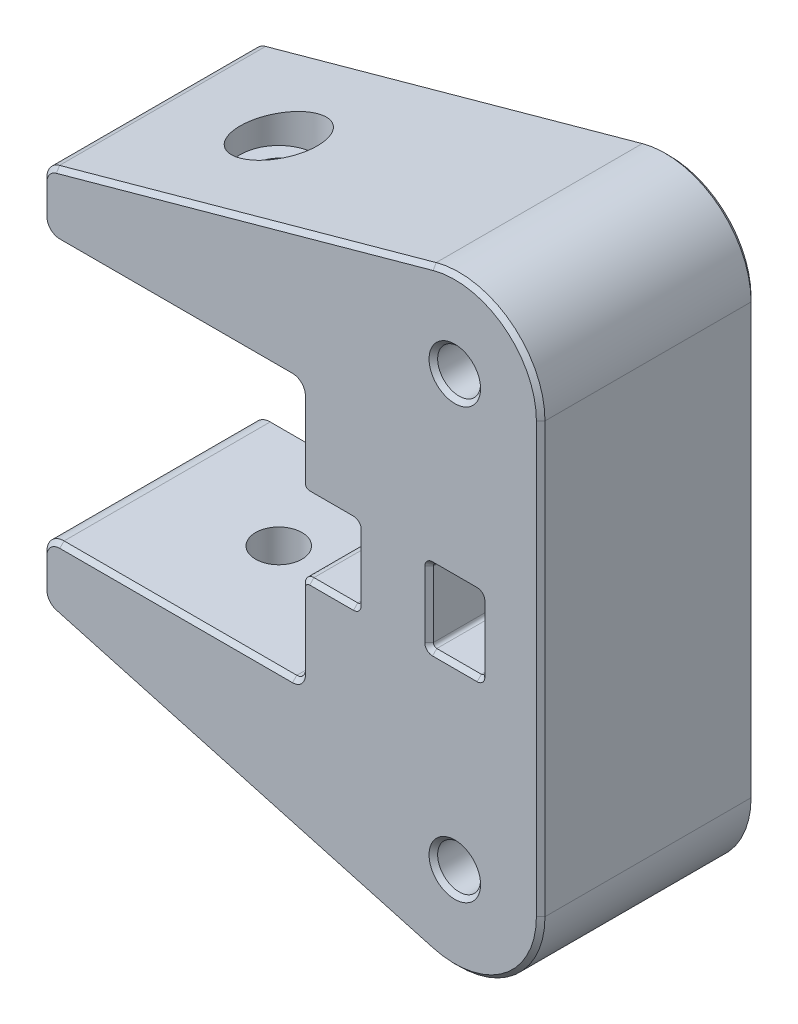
from build123d import *

# Parameters (mm, degrees)
DODANIE_WYCI_GNI_CIE1_DEPTH     = 21
SZKIC3_R                        = 2.5
DODANIE_WYCI_GNI_CIE2_DEPTH     = 4
WYTNIJ_WYCI_GNI_CIE1_DEPTH      = 81.61643753
WYTNIJ_WYCI_GNI_CIE1_DEPTH_BACK = 81.61643753
SZKIC4_R                        = 2.7
SZKIC7_R                        = 4.5
WYTNIJ_WYCI_GNI_CIE4_DEPTH      = 20
WYTNIJ_WYCI_GNI_CIE5_START      = -20
SZKIC8_R                        = 4.5
WYTNIJ_WYCI_GNI_CIE5_DEPTH      = 20
SZKIC9_W                        = 6
SZKIC9_H                        = 8.5
SZKIC9_W_2                      = 6.5
WYTNIJ_WYCI_GNI_CIE6_DEPTH      = 81.554329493
ZAOKR_GLENIE1_R                 = 2
ZAOKR_GLENIE2_R                 = 0.4
ZAOKR_GLENIE3_R                 = 1
ZAOKR_GLENIE4_R                 = 2
SFAZOWANIE1_SIZE                = 0.5


with BuildPart() as part:
    # Szkic1 → Dodanie-wyci_gni_cie1 (new body)
    with BuildSketch(Plane.XY):
        with BuildLine():
            Line((0, 30.1), (0, 37.1))
            Line((0, 37.1), (45.334360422, 49.638172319))
            ThreePointArc((45.334360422, 49.638172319), (54.055724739, 47.957901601), (58, 40))
            Line((58, 40), (58, -10))
            ThreePointArc((58, -10), (54.055724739, -17.957901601), (45.334360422, -19.638172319))
            Line((45.334360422, -19.638172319), (0, -7.1))
            Line((0, -7.1), (0, -0.1))
            Line((0, -0.1), (30.1, -0.1))
            Line((30.1, -0.1), (30.1, 30.1))
            Line((30.1, 30.1), (0, 30.1))
        make_face()
        Polygon((43.381197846, 40), (45.690598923, 36), (50.309401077, 36), (52.618802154, 40), (50.309401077, 44), (45.690598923, 44), align=None, mode=Mode.SUBTRACT)
        Polygon((52.618802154, -10), (50.309401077, -6), (45.690598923, -6), (43.381197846, -10), (45.690598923, -14), (50.309401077, -14), align=None, mode=Mode.SUBTRACT)
    extrude(amount=DODANIE_WYCI_GNI_CIE1_DEPTH)

    # Szkic3 → Dodanie-wyci_gni_cie2 (add)
    with BuildSketch(Plane.XY.offset(21)):
        with BuildLine():
            Line((0, 30.1), (30.1, 30.1))
            Line((30.1, 30.1), (30.1, -0.1))
            Line((30.1, -0.1), (0, -0.1))
            Line((0, -0.1), (0, -7.1))
            Line((0, -7.1), (45.334360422, -19.638172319))
            ThreePointArc((45.334360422, -19.638172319), (54.055724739, -17.957901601), (58, -10))
            Line((58, -10), (58, 40))
            ThreePointArc((58, 40), (54.055724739, 47.957901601), (45.334360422, 49.638172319))
            Line((45.334360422, 49.638172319), (0, 37.1))
            Line((0, 37.1), (0, 30.1))
        make_face()
        with Locations((48, 40)):
            Circle(SZKIC3_R, mode=Mode.SUBTRACT)
        with Locations((48, -10)):
            Circle(SZKIC3_R, mode=Mode.SUBTRACT)
    extrude(amount=DODANIE_WYCI_GNI_CIE2_DEPTH)

    # Szkic4 → Wytnij-wyci_gni_cie1 (cut, two sides: drawn at the far end of the back side and taken through both)
    with BuildSketch(Plane(origin=(0, -0.1, 0), x_dir=(1, 0, 0), z_dir=(0, 1, 0)).offset(-WYTNIJ_WYCI_GNI_CIE1_DEPTH_BACK)):
        with Locations(Location((15, -12.5, 0), (0, 0, 270))):
            Circle(SZKIC4_R)
    extrude(amount=WYTNIJ_WYCI_GNI_CIE1_DEPTH + WYTNIJ_WYCI_GNI_CIE1_DEPTH_BACK, mode=Mode.SUBTRACT)

    # Szkic7 → Wytnij-wyci_gni_cie4 (cut)
    with BuildSketch(Plane(origin=(0, -7.1, 0), x_dir=(-1, 0, 0), z_dir=(0, -1, 0))):
        with Locations((-15, -12.5)):
            Circle(SZKIC7_R)
    extrude(amount=WYTNIJ_WYCI_GNI_CIE4_DEPTH, mode=Mode.SUBTRACT)

    # Szkic8 → Wytnij-wyci_gni_cie5 (cut)
    with BuildSketch(Plane(origin=(0, 37.1, 0), x_dir=(-1, 0, 0), z_dir=(0, -1, 0)).offset(WYTNIJ_WYCI_GNI_CIE5_START)):
        with Locations((-15, -12.5)):
            Circle(SZKIC8_R)
    extrude(amount=WYTNIJ_WYCI_GNI_CIE5_DEPTH, mode=Mode.SUBTRACT)

    # Szkic9 → Wytnij-wyci_gni_cie6 (cut, through all)
    with BuildSketch(Plane(origin=(0, 0, 0), x_dir=(-1, 0, 0), z_dir=(0, 0, -1))):
        with Locations((-48, 15)):
            Rectangle(SZKIC9_W, SZKIC9_H)
        with Locations((-33.35, 15)):
            Rectangle(SZKIC9_W_2, SZKIC9_H)
    extrude(amount=-WYTNIJ_WYCI_GNI_CIE6_DEPTH, mode=Mode.SUBTRACT)

    # Zaokr_glenie1
    zaokr_glenie1_edges = [part.edges().sort_by_distance(p)[0] for p in [
        (0, 30.1, 12.5),
        (0, 37.1, 12.5),
        (0, -7.1, 12.5),
        (0, -0.1, 12.5),
    ]]
    fillet(zaokr_glenie1_edges, radius=ZAOKR_GLENIE1_R)

    # Zaokr_glenie2
    zaokr_glenie2_edges = [part.edges().sort_by_distance(p)[0] for p in [
        (51, 19.25, 12.5),
        (45, 19.25, 12.5),
        (45, 10.75, 12.5),
        (51, 10.75, 12.5),
        (36.6, 10.75, 12.5),
        (36.6, 19.25, 12.5),
    ]]
    fillet(zaokr_glenie2_edges, radius=ZAOKR_GLENIE2_R)

    # Zaokr_glenie3
    zaokr_glenie3_edges = [part.edges().sort_by_distance(p)[0] for p in [
        (30.1, 19.25, 12.5),
        (30.1, 10.75, 12.5),
        (30.1, -0.1, 12.5),
        (30.1, 30.1, 12.5),
    ]]
    fillet(zaokr_glenie3_edges, radius=ZAOKR_GLENIE3_R)

    # Zaokr_glenie4
    zaokr_glenie4_edges = [part.edges().sort_by_distance(p)[0] for p in [
        (45.690598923, 44, 10.5),
        (43.381197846, 40, 10.5),
        (45.690598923, 36, 10.5),
        (50.309401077, 36, 10.5),
        (52.618802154, 40, 10.5),
        (50.309401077, 44, 10.5),
        (50.309401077, -14, 10.5),
        (52.618802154, -10, 10.5),
        (50.309401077, -6, 10.5),
        (45.690598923, -6, 10.5),
        (43.381197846, -10, 10.5),
        (45.690598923, -14, 10.5),
    ]]
    fillet(zaokr_glenie4_edges, radius=ZAOKR_GLENIE4_R)

    # Sfazowanie1
    sfazowanie1_edges = [part.edges().sort_by_distance(p)[0] for p in [
        (23.400616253, 43.571933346, 0),
        (54.055724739, 47.957901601, 0),
        (58, 15, 0),
        (54.055724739, -17.957901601, 0),
        (23.400616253, -13.571933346, 0),
        (23.400616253, -13.571933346, 25),
        (15.55, 30.1, 0),
        (0, 33.839029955, 0),
        (0, -3.839029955, 0),
        (0.40841968, 36.789204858, 0),
        (0.585786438, 30.685786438, 0),
        (0.585786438, -0.685786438, 0),
        (0.40841968, -6.789204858, 0),
        (0, -3.839029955, 25),
        (0, 33.839029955, 25),
        (15.55, 30.1, 25),
        (0.40841968, 36.789204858, 25),
        (0.585786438, 30.685786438, 25),
        (0.585786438, -0.685786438, 25),
        (0.40841968, -6.789204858, 25),
        (45, 15, 0),
        (45, 15, 25),
        (48, 10.75, 0),
        (48, 10.75, 25),
        (51, 15, 0),
        (51, 15, 25),
        (48, 19.25, 0),
        (48, 19.25, 25),
        (33.65, 10.75, 0),
        (33.65, 10.75, 25),
        (36.6, 15, 0),
        (36.6, 15, 25),
        (45.117157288, 10.867157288, 0),
        (45.117157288, 10.867157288, 25),
        (50.882842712, 10.867157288, 0),
        (50.882842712, 10.867157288, 25),
        (45.117157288, 19.132842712, 0),
        (45.117157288, 19.132842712, 25),
        (50.882842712, 19.132842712, 0),
        (50.882842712, 19.132842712, 25),
        (36.482842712, 10.867157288, 0),
        (36.482842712, 10.867157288, 25),
        (36.482842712, 19.132842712, 0),
        (36.482842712, 19.132842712, 25),
        (33.65, 19.25, 0),
        (33.65, 19.25, 25),
        (15.55, -0.1, 0),
        (30.1, 5.325, 0),
        (30.1, 24.675, 0),
        (30.392893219, 10.457106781, 0),
        (30.392893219, 19.542893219, 0),
        (30.1, 24.675, 25),
        (30.1, 5.325, 25),
        (15.55, -0.1, 25),
        (30.392893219, 10.457106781, 25),
        (30.392893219, 19.542893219, 25),
        (29.807106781, 0.192893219, 0),
        (29.807106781, 0.192893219, 25),
        (29.807106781, 29.807106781, 0),
        (29.807106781, 29.807106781, 25),
        (44.535898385, -8, 0),
        (44.535898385, -12, 0),
        (48, -6, 0),
        (51.464101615, -8, 0),
        (51.464101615, -12, 0),
        (48, -14, 0),
        (48, 36, 0),
        (51.464101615, 38, 0),
        (51.464101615, 42, 0),
        (48, 44, 0),
        (44.535898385, 42, 0),
        (44.535898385, 38, 0),
        (43.690598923, -10, 0),
        (45.845299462, -6.267949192, 0),
        (50.154700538, -6.267949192, 0),
        (52.309401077, -10, 0),
        (50.154700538, -13.732050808, 0),
        (45.845299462, -13.732050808, 0),
        (50.154700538, 36.267949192, 0),
        (52.309401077, 40, 0),
        (50.154700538, 43.732050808, 0),
        (45.845299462, 43.732050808, 0),
        (43.690598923, 40, 0),
        (45.845299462, 36.267949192, 0),
        (54.055724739, -17.957901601, 25),
        (58, 15, 25),
        (54.055724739, 47.957901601, 25),
        (23.400616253, 43.571933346, 25),
        (45.5, 40, 25),
        (45.5, -10, 25),
    ]]
    chamfer(sfazowanie1_edges, length=SFAZOWANIE1_SIZE)


solid = part.part
